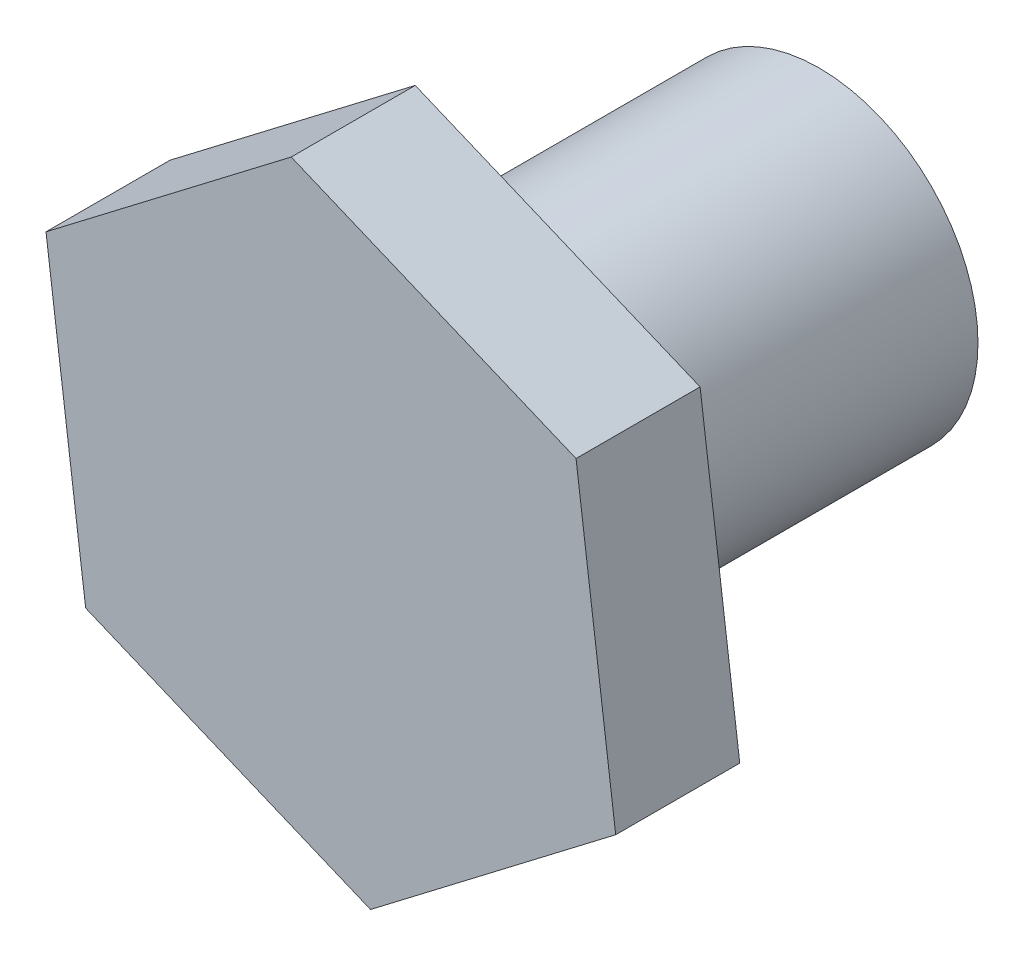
ISO-10303-21;
HEADER;
FILE_DESCRIPTION(('STEP AP214'),'2;1');
FILE_NAME('part.step','',(''),(''),'','','');
FILE_SCHEMA(('AUTOMOTIVE_DESIGN { 1 0 10303 214 1 1 1 1 }'));
ENDSEC;
DATA;
#1=APPLICATION_CONTEXT('core data for automotive mechanical design processes');
#2=APPLICATION_PROTOCOL_DEFINITION('international standard','automotive_design',2000,#1);
#3=PRODUCT_CONTEXT('',#1,'mechanical');
#4=PRODUCT('Part','Part','',(#3));
#5=PRODUCT_RELATED_PRODUCT_CATEGORY('part','',(#4));
#6=PRODUCT_DEFINITION_FORMATION('','',#4);
#7=PRODUCT_DEFINITION_CONTEXT('part definition',#1,'design');
#8=PRODUCT_DEFINITION('design','',#6,#7);
#9=PRODUCT_DEFINITION_SHAPE('','',#8);
#10=(LENGTH_UNIT() NAMED_UNIT(*) SI_UNIT(.MILLI.,.METRE.));
#11=(NAMED_UNIT(*) PLANE_ANGLE_UNIT() SI_UNIT($,.RADIAN.));
#12=(NAMED_UNIT(*) SI_UNIT($,.STERADIAN.) SOLID_ANGLE_UNIT());
#13=UNCERTAINTY_MEASURE_WITH_UNIT(LENGTH_MEASURE(1.E-05),#10,'distance_accuracy_value','');
#14=(GEOMETRIC_REPRESENTATION_CONTEXT(3) GLOBAL_UNCERTAINTY_ASSIGNED_CONTEXT((#13)) GLOBAL_UNIT_ASSIGNED_CONTEXT((#10,
#11,#12)) REPRESENTATION_CONTEXT('',''));
#15=CARTESIAN_POINT('',(0.,0.,0.));
#16=DIRECTION('',(0.,0.,1.));
#17=DIRECTION('',(1.,0.,0.));
#18=AXIS2_PLACEMENT_3D('',#15,#16,#17);
#19=CARTESIAN_POINT('',(-24.0117340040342,40.7938382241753,-11.938));
#20=DIRECTION('',(0.,0.,1.));
#21=DIRECTION('',(1.,0.,0.));
#22=AXIS2_PLACEMENT_3D('',#19,#20,#21);
#23=CYLINDRICAL_SURFACE('',#22,5.19980387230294);
#24=CARTESIAN_POINT('',(-24.0117340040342,40.7938382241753,-11.938));
#25=DIRECTION('',(0.,0.,1.));
#26=DIRECTION('',(1.,0.,0.));
#27=AXIS2_PLACEMENT_3D('',#24,#25,#26);
#28=CIRCLE('',#27,5.19980387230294);
#29=CARTESIAN_POINT('',(-18.8119301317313,40.7938382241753,-11.938));
#30=VERTEX_POINT('',#29);
#31=EDGE_CURVE('E11',#30,#30,#28,.T.);
#32=ORIENTED_EDGE('',*,*,#31,.T.);
#33=EDGE_LOOP('',(#32));
#34=FACE_BOUND('',#33,.T.);
#35=CARTESIAN_POINT('',(-24.0117340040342,40.7938382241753,0.));
#36=DIRECTION('',(0.,0.,1.));
#37=DIRECTION('',(1.,0.,0.));
#38=AXIS2_PLACEMENT_3D('',#35,#36,#37);
#39=CIRCLE('',#38,5.19980387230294);
#40=CARTESIAN_POINT('',(-18.8119301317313,40.7938382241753,0.));
#41=VERTEX_POINT('',#40);
#42=EDGE_CURVE('E40',#41,#41,#39,.T.);
#43=ORIENTED_EDGE('',*,*,#42,.F.);
#44=EDGE_LOOP('',(#43));
#45=FACE_BOUND('',#44,.T.);
#46=ADVANCED_FACE('F33',(#34,#45),#23,.T.);
#47=CARTESIAN_POINT('',(-24.0117340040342,40.7938382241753,-11.938));
#48=DIRECTION('',(0.,0.,1.));
#49=DIRECTION('',(1.,0.,0.));
#50=AXIS2_PLACEMENT_3D('',#47,#48,#49);
#51=PLANE('',#50);
#52=ORIENTED_EDGE('',*,*,#31,.F.);
#53=EDGE_LOOP('',(#52));
#54=FACE_BOUND('',#53,.T.);
#55=ADVANCED_FACE('F141',(#54),#51,.F.);
#56=CARTESIAN_POINT('',(-32.0447715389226,34.6558247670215,4.064));
#57=DIRECTION('',(0.384564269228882,0.923098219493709,0.));
#58=DIRECTION('',(-0.923098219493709,0.384564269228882,0.));
#59=AXIS2_PLACEMENT_3D('',#56,#57,#58);
#60=PLANE('',#59);
#61=DIRECTION('',(0.923098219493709,-0.384564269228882,0.));
#62=VECTOR('',#61,1.);
#63=CARTESIAN_POINT('',(-32.0447715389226,34.6558247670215,0.));
#64=LINE('',#63,#62);
#65=CARTESIAN_POINT('',(-32.0447715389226,34.6558247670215,0.));
#66=VERTEX_POINT('',#65);
#67=CARTESIAN_POINT('',(-22.7125771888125,30.7680169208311,0.));
#68=VERTEX_POINT('',#67);
#69=EDGE_CURVE('E90',#66,#68,#64,.T.);
#70=ORIENTED_EDGE('',*,*,#69,.T.);
#71=DIRECTION('',(0.,0.,-1.));
#72=VECTOR('',#71,1.);
#73=CARTESIAN_POINT('',(-22.7125771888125,30.7680169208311,4.064));
#74=LINE('',#73,#72);
#75=CARTESIAN_POINT('',(-22.7125771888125,30.7680169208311,4.064));
#76=VERTEX_POINT('',#75);
#77=EDGE_CURVE('E98',#76,#68,#74,.T.);
#78=ORIENTED_EDGE('',*,*,#77,.F.);
#79=DIRECTION('',(0.923098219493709,-0.384564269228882,0.));
#80=VECTOR('',#79,1.);
#81=CARTESIAN_POINT('',(-32.0447715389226,34.6558247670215,4.064));
#82=LINE('',#81,#80);
#83=CARTESIAN_POINT('',(-32.0447715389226,34.6558247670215,4.064));
#84=VERTEX_POINT('',#83);
#85=EDGE_CURVE('E117',#84,#76,#82,.T.);
#86=ORIENTED_EDGE('',*,*,#85,.F.);
#87=DIRECTION('',(0.,0.,-1.));
#88=VECTOR('',#87,1.);
#89=CARTESIAN_POINT('',(-32.0447715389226,34.6558247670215,4.064));
#90=LINE('',#89,#88);
#91=EDGE_CURVE('E107',#84,#66,#90,.T.);
#92=ORIENTED_EDGE('',*,*,#91,.T.);
#93=EDGE_LOOP('',(#70,#78,#86,#92));
#94=FACE_BOUND('',#93,.T.);
#95=ADVANCED_FACE('F106',(#94),#60,.F.);
#96=CARTESIAN_POINT('',(-22.7125771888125,30.7680169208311,4.064));
#97=DIRECTION('',(-0.607144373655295,0.794591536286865,0.));
#98=DIRECTION('',(-0.794591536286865,-0.607144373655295,0.));
#99=AXIS2_PLACEMENT_3D('',#96,#97,#98);
#100=PLANE('',#99);
#101=DIRECTION('',(0.794591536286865,0.607144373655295,0.));
#102=VECTOR('',#101,1.);
#103=CARTESIAN_POINT('',(-22.7125771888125,30.7680169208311,0.));
#104=LINE('',#103,#102);
#105=CARTESIAN_POINT('',(-14.6795396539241,36.9060303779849,0.));
#106=VERTEX_POINT('',#105);
#107=EDGE_CURVE('E85',#68,#106,#104,.T.);
#108=ORIENTED_EDGE('',*,*,#107,.T.);
#109=DIRECTION('',(0.,0.,-1.));
#110=VECTOR('',#109,1.);
#111=CARTESIAN_POINT('',(-14.6795396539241,36.9060303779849,4.064));
#112=LINE('',#111,#110);
#113=CARTESIAN_POINT('',(-14.6795396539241,36.9060303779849,4.064));
#114=VERTEX_POINT('',#113);
#115=EDGE_CURVE('E103',#114,#106,#112,.T.);
#116=ORIENTED_EDGE('',*,*,#115,.F.);
#117=DIRECTION('',(0.794591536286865,0.607144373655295,0.));
#118=VECTOR('',#117,1.);
#119=CARTESIAN_POINT('',(-22.7125771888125,30.7680169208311,4.064));
#120=LINE('',#119,#118);
#121=EDGE_CURVE('E100',#76,#114,#120,.T.);
#122=ORIENTED_EDGE('',*,*,#121,.F.);
#123=ORIENTED_EDGE('',*,*,#77,.T.);
#124=EDGE_LOOP('',(#108,#116,#122,#123));
#125=FACE_BOUND('',#124,.T.);
#126=ADVANCED_FACE('F99',(#125),#100,.F.);
#127=CARTESIAN_POINT('',(-14.6795396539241,36.9060303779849,4.064));
#128=DIRECTION('',(-0.991708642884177,-0.128506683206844,0.));
#129=DIRECTION('',(0.128506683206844,-0.991708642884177,0.));
#130=AXIS2_PLACEMENT_3D('',#127,#128,#129);
#131=PLANE('',#130);
#132=DIRECTION('',(-0.128506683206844,0.991708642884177,0.));
#133=VECTOR('',#132,1.);
#134=CARTESIAN_POINT('',(-14.6795396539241,36.9060303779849,0.));
#135=LINE('',#134,#133);
#136=CARTESIAN_POINT('',(-15.9786964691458,46.931851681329,0.));
#137=VERTEX_POINT('',#136);
#138=EDGE_CURVE('E92',#106,#137,#135,.T.);
#139=ORIENTED_EDGE('',*,*,#138,.T.);
#140=DIRECTION('',(0.,0.,-1.));
#141=VECTOR('',#140,1.);
#142=CARTESIAN_POINT('',(-15.9786964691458,46.931851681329,4.064));
#143=LINE('',#142,#141);
#144=CARTESIAN_POINT('',(-15.9786964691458,46.931851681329,4.064));
#145=VERTEX_POINT('',#144);
#146=EDGE_CURVE('E133',#145,#137,#143,.T.);
#147=ORIENTED_EDGE('',*,*,#146,.F.);
#148=DIRECTION('',(-0.128506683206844,0.991708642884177,0.));
#149=VECTOR('',#148,1.);
#150=CARTESIAN_POINT('',(-14.6795396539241,36.9060303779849,4.064));
#151=LINE('',#150,#149);
#152=EDGE_CURVE('E120',#114,#145,#151,.T.);
#153=ORIENTED_EDGE('',*,*,#152,.F.);
#154=ORIENTED_EDGE('',*,*,#115,.T.);
#155=EDGE_LOOP('',(#139,#147,#153,#154));
#156=FACE_BOUND('',#155,.T.);
#157=ADVANCED_FACE('F155',(#156),#131,.F.);
#158=CARTESIAN_POINT('',(-15.9786964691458,46.931851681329,4.064));
#159=DIRECTION('',(-0.384564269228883,-0.923098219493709,0.));
#160=DIRECTION('',(0.923098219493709,-0.384564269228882,0.));
#161=AXIS2_PLACEMENT_3D('',#158,#159,#160);
#162=PLANE('',#161);
#163=DIRECTION('',(-0.923098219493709,0.384564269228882,0.));
#164=VECTOR('',#163,1.);
#165=CARTESIAN_POINT('',(-15.9786964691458,46.931851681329,0.));
#166=LINE('',#165,#164);
#167=CARTESIAN_POINT('',(-25.310890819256,50.8196595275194,0.));
#168=VERTEX_POINT('',#167);
#169=EDGE_CURVE('E111',#137,#168,#166,.T.);
#170=ORIENTED_EDGE('',*,*,#169,.T.);
#171=DIRECTION('',(0.,0.,-1.));
#172=VECTOR('',#171,1.);
#173=CARTESIAN_POINT('',(-25.310890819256,50.8196595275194,4.064));
#174=LINE('',#173,#172);
#175=CARTESIAN_POINT('',(-25.310890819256,50.8196595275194,4.064));
#176=VERTEX_POINT('',#175);
#177=EDGE_CURVE('E130',#176,#168,#174,.T.);
#178=ORIENTED_EDGE('',*,*,#177,.F.);
#179=DIRECTION('',(-0.923098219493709,0.384564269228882,0.));
#180=VECTOR('',#179,1.);
#181=CARTESIAN_POINT('',(-15.9786964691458,46.931851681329,4.064));
#182=LINE('',#181,#180);
#183=EDGE_CURVE('E122',#145,#176,#182,.T.);
#184=ORIENTED_EDGE('',*,*,#183,.F.);
#185=ORIENTED_EDGE('',*,*,#146,.T.);
#186=EDGE_LOOP('',(#170,#178,#184,#185));
#187=FACE_BOUND('',#186,.T.);
#188=ADVANCED_FACE('F158',(#187),#162,.F.);
#189=CARTESIAN_POINT('',(-25.310890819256,50.8196595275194,4.064));
#190=DIRECTION('',(0.607144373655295,-0.794591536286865,0.));
#191=DIRECTION('',(0.794591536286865,0.607144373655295,0.));
#192=AXIS2_PLACEMENT_3D('',#189,#190,#191);
#193=PLANE('',#192);
#194=DIRECTION('',(-0.794591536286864,-0.607144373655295,0.));
#195=VECTOR('',#194,1.);
#196=CARTESIAN_POINT('',(-25.310890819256,50.8196595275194,0.));
#197=LINE('',#196,#195);
#198=CARTESIAN_POINT('',(-33.3439283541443,44.6816460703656,0.));
#199=VERTEX_POINT('',#198);
#200=EDGE_CURVE('E113',#168,#199,#197,.T.);
#201=ORIENTED_EDGE('',*,*,#200,.T.);
#202=DIRECTION('',(0.,0.,-1.));
#203=VECTOR('',#202,1.);
#204=CARTESIAN_POINT('',(-33.3439283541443,44.6816460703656,4.064));
#205=LINE('',#204,#203);
#206=CARTESIAN_POINT('',(-33.3439283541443,44.6816460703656,4.064));
#207=VERTEX_POINT('',#206);
#208=EDGE_CURVE('E127',#207,#199,#205,.T.);
#209=ORIENTED_EDGE('',*,*,#208,.F.);
#210=DIRECTION('',(-0.794591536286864,-0.607144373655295,0.));
#211=VECTOR('',#210,1.);
#212=CARTESIAN_POINT('',(-25.310890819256,50.8196595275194,4.064));
#213=LINE('',#212,#211);
#214=EDGE_CURVE('E52',#176,#207,#213,.T.);
#215=ORIENTED_EDGE('',*,*,#214,.F.);
#216=ORIENTED_EDGE('',*,*,#177,.T.);
#217=EDGE_LOOP('',(#201,#209,#215,#216));
#218=FACE_BOUND('',#217,.T.);
#219=ADVANCED_FACE('F162',(#218),#193,.F.);
#220=CARTESIAN_POINT('',(-33.3439283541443,44.6816460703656,4.064));
#221=DIRECTION('',(0.991708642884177,0.128506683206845,0.));
#222=DIRECTION('',(-0.128506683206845,0.991708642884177,0.));
#223=AXIS2_PLACEMENT_3D('',#220,#221,#222);
#224=PLANE('',#223);
#225=DIRECTION('',(0.128506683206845,-0.991708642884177,0.));
#226=VECTOR('',#225,1.);
#227=CARTESIAN_POINT('',(-33.3439283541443,44.6816460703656,0.));
#228=LINE('',#227,#226);
#229=EDGE_CURVE('E115',#199,#66,#228,.T.);
#230=ORIENTED_EDGE('',*,*,#229,.T.);
#231=ORIENTED_EDGE('',*,*,#91,.F.);
#232=DIRECTION('',(0.128506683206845,-0.991708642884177,0.));
#233=VECTOR('',#232,1.);
#234=CARTESIAN_POINT('',(-33.3439283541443,44.6816460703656,4.064));
#235=LINE('',#234,#233);
#236=EDGE_CURVE('E47',#207,#84,#235,.T.);
#237=ORIENTED_EDGE('',*,*,#236,.F.);
#238=ORIENTED_EDGE('',*,*,#208,.T.);
#239=EDGE_LOOP('',(#230,#231,#237,#238));
#240=FACE_BOUND('',#239,.T.);
#241=ADVANCED_FACE('F166',(#240),#224,.F.);
#242=CARTESIAN_POINT('',(-41.3769658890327,38.5436326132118,4.064));
#243=DIRECTION('',(0.,0.,-1.));
#244=DIRECTION('',(-1.,0.,0.));
#245=AXIS2_PLACEMENT_3D('',#242,#243,#244);
#246=PLANE('',#245);
#247=ORIENTED_EDGE('',*,*,#85,.T.);
#248=ORIENTED_EDGE('',*,*,#121,.T.);
#249=ORIENTED_EDGE('',*,*,#152,.T.);
#250=ORIENTED_EDGE('',*,*,#183,.T.);
#251=ORIENTED_EDGE('',*,*,#214,.T.);
#252=ORIENTED_EDGE('',*,*,#236,.T.);
#253=EDGE_LOOP('',(#247,#248,#249,#250,#251,#252));
#254=FACE_BOUND('',#253,.T.);
#255=ADVANCED_FACE('F170',(#254),#246,.F.);
#256=CARTESIAN_POINT('',(-41.3769658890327,38.5436326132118,0.));
#257=DIRECTION('',(0.,0.,-1.));
#258=DIRECTION('',(-1.,0.,0.));
#259=AXIS2_PLACEMENT_3D('',#256,#257,#258);
#260=PLANE('',#259);
#261=ORIENTED_EDGE('',*,*,#42,.T.);
#262=EDGE_LOOP('',(#261));
#263=FACE_BOUND('',#262,.T.);
#264=ORIENTED_EDGE('',*,*,#69,.F.);
#265=ORIENTED_EDGE('',*,*,#229,.F.);
#266=ORIENTED_EDGE('',*,*,#200,.F.);
#267=ORIENTED_EDGE('',*,*,#169,.F.);
#268=ORIENTED_EDGE('',*,*,#138,.F.);
#269=ORIENTED_EDGE('',*,*,#107,.F.);
#270=EDGE_LOOP('',(#264,#265,#266,#267,#268,#269));
#271=FACE_BOUND('',#270,.T.);
#272=ADVANCED_FACE('F87',(#263,#271),#260,.T.);
#273=CLOSED_SHELL('',(#46,#55,#95,#126,#157,#188,#219,#241,#255,#272));
#274=MANIFOLD_SOLID_BREP('B2',#273);
#275=ADVANCED_BREP_SHAPE_REPRESENTATION('',(#18,#274),#14);
#276=SHAPE_DEFINITION_REPRESENTATION(#9,#275);
ENDSEC;
END-ISO-10303-21;
